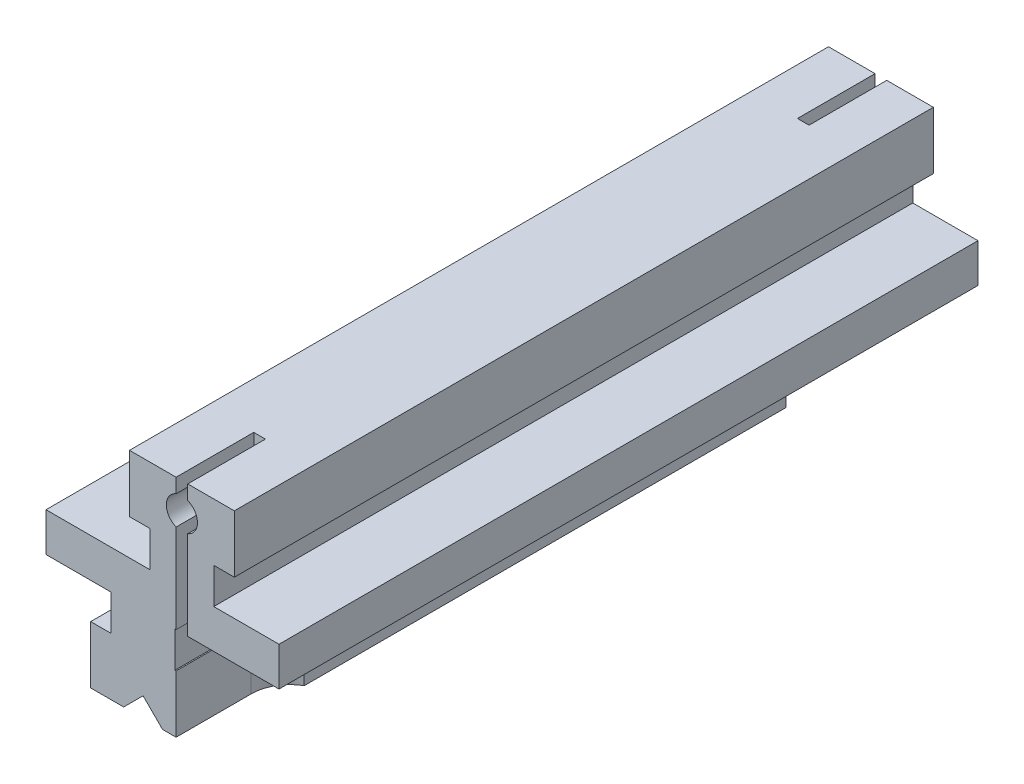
ISO-10303-21;
HEADER;
FILE_DESCRIPTION(('STEP AP214'),'2;1');
FILE_NAME('part.step','',(''),(''),'','','');
FILE_SCHEMA(('AUTOMOTIVE_DESIGN { 1 0 10303 214 1 1 1 1 }'));
ENDSEC;
DATA;
#1=APPLICATION_CONTEXT('core data for automotive mechanical design processes');
#2=APPLICATION_PROTOCOL_DEFINITION('international standard','automotive_design',2000,#1);
#3=PRODUCT_CONTEXT('',#1,'mechanical');
#4=PRODUCT('Part','Part','',(#3));
#5=PRODUCT_RELATED_PRODUCT_CATEGORY('part','',(#4));
#6=PRODUCT_DEFINITION_FORMATION('','',#4);
#7=PRODUCT_DEFINITION_CONTEXT('part definition',#1,'design');
#8=PRODUCT_DEFINITION('design','',#6,#7);
#9=PRODUCT_DEFINITION_SHAPE('','',#8);
#10=(LENGTH_UNIT() NAMED_UNIT(*) SI_UNIT(.MILLI.,.METRE.));
#11=(NAMED_UNIT(*) PLANE_ANGLE_UNIT() SI_UNIT($,.RADIAN.));
#12=(NAMED_UNIT(*) SI_UNIT($,.STERADIAN.) SOLID_ANGLE_UNIT());
#13=UNCERTAINTY_MEASURE_WITH_UNIT(LENGTH_MEASURE(1.E-05),#10,'distance_accuracy_value','');
#14=(GEOMETRIC_REPRESENTATION_CONTEXT(3) GLOBAL_UNCERTAINTY_ASSIGNED_CONTEXT((#13)) GLOBAL_UNIT_ASSIGNED_CONTEXT((#10,
#11,#12)) REPRESENTATION_CONTEXT('',''));
#15=CARTESIAN_POINT('',(0.,0.,0.));
#16=DIRECTION('',(0.,0.,1.));
#17=DIRECTION('',(1.,0.,0.));
#18=AXIS2_PLACEMENT_3D('',#15,#16,#17);
#19=CARTESIAN_POINT('',(5.,13.2999954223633,45.));
#20=DIRECTION('',(0.,0.,-1.));
#21=DIRECTION('',(-1.,0.,0.));
#22=AXIS2_PLACEMENT_3D('',#19,#20,#21);
#23=CYLINDRICAL_SURFACE('',#22,2.);
#24=DIRECTION('',(0.,0.,-1.));
#25=VECTOR('',#24,1.);
#26=CARTESIAN_POINT('',(5.75,11.4459458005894,45.));
#27=LINE('',#26,#25);
#28=CARTESIAN_POINT('',(5.75,11.4459458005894,35.));
#29=VERTEX_POINT('',#28);
#30=CARTESIAN_POINT('',(5.75,11.4459458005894,45.));
#31=VERTEX_POINT('',#30);
#32=EDGE_CURVE('E287',#29,#31,#27,.F.);
#33=ORIENTED_EDGE('',*,*,#32,.T.);
#34=CARTESIAN_POINT('',(5.,13.2999954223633,45.));
#35=DIRECTION('',(0.,0.,-1.));
#36=DIRECTION('',(-1.,0.,0.));
#37=AXIS2_PLACEMENT_3D('',#34,#35,#36);
#38=CIRCLE('',#37,2.);
#39=CARTESIAN_POINT('',(5.75,15.1540450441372,45.));
#40=VERTEX_POINT('',#39);
#41=EDGE_CURVE('E296',#40,#31,#38,.T.);
#42=ORIENTED_EDGE('',*,*,#41,.F.);
#43=DIRECTION('',(0.,0.,-1.));
#44=VECTOR('',#43,1.);
#45=CARTESIAN_POINT('',(5.75,15.1540450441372,45.));
#46=LINE('',#45,#44);
#47=CARTESIAN_POINT('',(5.75,15.1540450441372,35.));
#48=VERTEX_POINT('',#47);
#49=EDGE_CURVE('E292',#40,#48,#46,.T.);
#50=ORIENTED_EDGE('',*,*,#49,.T.);
#51=CARTESIAN_POINT('',(5.,13.2999954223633,35.));
#52=DIRECTION('',(0.,0.,-1.));
#53=DIRECTION('',(-1.,0.,0.));
#54=AXIS2_PLACEMENT_3D('',#51,#52,#53);
#55=CIRCLE('',#54,2.);
#56=EDGE_CURVE('E19',#29,#48,#55,.F.);
#57=ORIENTED_EDGE('',*,*,#56,.F.);
#58=EDGE_LOOP('',(#33,#42,#50,#57));
#59=FACE_BOUND('',#58,.T.);
#60=ADVANCED_FACE('F15',(#59),#23,.F.);
#61=CARTESIAN_POINT('',(9.10000610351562,5.,0.));
#62=DIRECTION('',(0.,1.,0.));
#63=DIRECTION('',(0.,0.,1.));
#64=AXIS2_PLACEMENT_3D('',#61,#62,#63);
#65=PLANE('',#64);
#66=DIRECTION('',(1.,0.,0.));
#67=VECTOR('',#66,1.);
#68=CARTESIAN_POINT('',(2.46334938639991,5.,-45.));
#69=LINE('',#68,#67);
#70=CARTESIAN_POINT('',(17.5,5.,-45.));
#71=VERTEX_POINT('',#70);
#72=CARTESIAN_POINT('',(9.10000610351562,5.,-45.));
#73=VERTEX_POINT('',#72);
#74=EDGE_CURVE('E449',#71,#73,#69,.F.);
#75=ORIENTED_EDGE('',*,*,#74,.T.);
#76=DIRECTION('',(0.,0.,-1.));
#77=VECTOR('',#76,1.);
#78=CARTESIAN_POINT('',(9.10000610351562,5.,0.));
#79=LINE('',#78,#77);
#80=CARTESIAN_POINT('',(9.10000610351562,5.,45.));
#81=VERTEX_POINT('',#80);
#82=EDGE_CURVE('E459',#81,#73,#79,.T.);
#83=ORIENTED_EDGE('',*,*,#82,.F.);
#84=DIRECTION('',(1.,0.,0.));
#85=VECTOR('',#84,1.);
#86=CARTESIAN_POINT('',(2.46334938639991,5.,45.));
#87=LINE('',#86,#85);
#88=CARTESIAN_POINT('',(17.5,5.,45.));
#89=VERTEX_POINT('',#88);
#90=EDGE_CURVE('E377',#89,#81,#87,.F.);
#91=ORIENTED_EDGE('',*,*,#90,.F.);
#92=DIRECTION('',(0.,0.,-1.));
#93=VECTOR('',#92,1.);
#94=CARTESIAN_POINT('',(17.5,5.,0.));
#95=LINE('',#94,#93);
#96=EDGE_CURVE('E458',#71,#89,#95,.F.);
#97=ORIENTED_EDGE('',*,*,#96,.F.);
#98=EDGE_LOOP('',(#75,#83,#91,#97));
#99=FACE_BOUND('',#98,.T.);
#100=ADVANCED_FACE('F475',(#99),#65,.T.);
#101=CARTESIAN_POINT('',(9.10000610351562,9.59999084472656,0.));
#102=DIRECTION('',(1.,0.,0.));
#103=DIRECTION('',(0.,0.,-1.));
#104=AXIS2_PLACEMENT_3D('',#101,#102,#103);
#105=PLANE('',#104);
#106=DIRECTION('',(0.,1.,0.));
#107=VECTOR('',#106,1.);
#108=CARTESIAN_POINT('',(9.10000610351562,2.34999266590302,-45.));
#109=LINE('',#108,#107);
#110=CARTESIAN_POINT('',(9.10000610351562,9.59999084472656,-45.));
#111=VERTEX_POINT('',#110);
#112=EDGE_CURVE('E463',#73,#111,#109,.T.);
#113=ORIENTED_EDGE('',*,*,#112,.T.);
#114=DIRECTION('',(0.,0.,-1.));
#115=VECTOR('',#114,1.);
#116=CARTESIAN_POINT('',(9.10000610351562,9.59999084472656,0.));
#117=LINE('',#116,#115);
#118=CARTESIAN_POINT('',(9.10000610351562,9.59999084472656,45.));
#119=VERTEX_POINT('',#118);
#120=EDGE_CURVE('E455',#119,#111,#117,.T.);
#121=ORIENTED_EDGE('',*,*,#120,.F.);
#122=DIRECTION('',(0.,1.,0.));
#123=VECTOR('',#122,1.);
#124=CARTESIAN_POINT('',(9.10000610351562,2.34999266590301,45.));
#125=LINE('',#124,#123);
#126=EDGE_CURVE('E372',#81,#119,#125,.T.);
#127=ORIENTED_EDGE('',*,*,#126,.F.);
#128=ORIENTED_EDGE('',*,*,#82,.T.);
#129=EDGE_LOOP('',(#113,#121,#127,#128));
#130=FACE_BOUND('',#129,.T.);
#131=ADVANCED_FACE('F479',(#130),#105,.T.);
#132=CARTESIAN_POINT('',(11.75,9.59999084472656,0.));
#133=DIRECTION('',(0.,-1.,0.));
#134=DIRECTION('',(0.,0.,-1.));
#135=AXIS2_PLACEMENT_3D('',#132,#133,#134);
#136=PLANE('',#135);
#137=DIRECTION('',(1.,0.,0.));
#138=VECTOR('',#137,1.);
#139=CARTESIAN_POINT('',(2.46334938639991,9.59999084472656,-45.));
#140=LINE('',#139,#138);
#141=CARTESIAN_POINT('',(11.75,9.59999084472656,-45.));
#142=VERTEX_POINT('',#141);
#143=EDGE_CURVE('E558',#111,#142,#140,.T.);
#144=ORIENTED_EDGE('',*,*,#143,.T.);
#145=DIRECTION('',(0.,0.,-1.));
#146=VECTOR('',#145,1.);
#147=CARTESIAN_POINT('',(11.75,9.59999084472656,0.));
#148=LINE('',#147,#146);
#149=CARTESIAN_POINT('',(11.75,9.59999084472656,45.));
#150=VERTEX_POINT('',#149);
#151=EDGE_CURVE('E367',#150,#142,#148,.T.);
#152=ORIENTED_EDGE('',*,*,#151,.F.);
#153=DIRECTION('',(1.,0.,0.));
#154=VECTOR('',#153,1.);
#155=CARTESIAN_POINT('',(2.46334938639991,9.59999084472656,45.));
#156=LINE('',#155,#154);
#157=EDGE_CURVE('E369',#119,#150,#156,.T.);
#158=ORIENTED_EDGE('',*,*,#157,.F.);
#159=ORIENTED_EDGE('',*,*,#120,.T.);
#160=EDGE_LOOP('',(#144,#152,#158,#159));
#161=FACE_BOUND('',#160,.T.);
#162=ADVANCED_FACE('F484',(#161),#136,.T.);
#163=CARTESIAN_POINT('',(5.,13.2999954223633,-45.));
#164=DIRECTION('',(0.,0.,1.));
#165=DIRECTION('',(0.,-1.,0.));
#166=AXIS2_PLACEMENT_3D('',#163,#164,#165);
#167=CYLINDRICAL_SURFACE('',#166,2.);
#168=DIRECTION('',(0.,0.,-1.));
#169=VECTOR('',#168,1.);
#170=CARTESIAN_POINT('',(5.75,15.1540450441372,-40.));
#171=LINE('',#170,#169);
#172=CARTESIAN_POINT('',(5.75,15.1540450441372,-35.));
#173=VERTEX_POINT('',#172);
#174=CARTESIAN_POINT('',(5.75,15.1540450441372,-45.));
#175=VERTEX_POINT('',#174);
#176=EDGE_CURVE('E301',#173,#175,#171,.T.);
#177=ORIENTED_EDGE('',*,*,#176,.T.);
#178=CARTESIAN_POINT('',(5.,13.2999954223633,-45.));
#179=DIRECTION('',(0.,0.,1.));
#180=DIRECTION('',(0.,-1.,0.));
#181=AXIS2_PLACEMENT_3D('',#178,#179,#180);
#182=CIRCLE('',#181,2.);
#183=CARTESIAN_POINT('',(5.75,11.4459458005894,-45.));
#184=VERTEX_POINT('',#183);
#185=EDGE_CURVE('E360',#175,#184,#182,.F.);
#186=ORIENTED_EDGE('',*,*,#185,.T.);
#187=DIRECTION('',(0.,0.,1.));
#188=VECTOR('',#187,1.);
#189=CARTESIAN_POINT('',(5.75,11.4459458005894,-40.));
#190=LINE('',#189,#188);
#191=CARTESIAN_POINT('',(5.75,11.4459458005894,-35.));
#192=VERTEX_POINT('',#191);
#193=EDGE_CURVE('E402',#184,#192,#190,.T.);
#194=ORIENTED_EDGE('',*,*,#193,.T.);
#195=CARTESIAN_POINT('',(5.00000000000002,13.2999954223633,-35.));
#196=DIRECTION('',(0.,0.,1.));
#197=DIRECTION('',(0.,-1.,0.));
#198=AXIS2_PLACEMENT_3D('',#195,#196,#197);
#199=CIRCLE('',#198,2.);
#200=EDGE_CURVE('E347',#173,#192,#199,.F.);
#201=ORIENTED_EDGE('',*,*,#200,.F.);
#202=EDGE_LOOP('',(#177,#186,#194,#201));
#203=FACE_BOUND('',#202,.T.);
#204=ADVANCED_FACE('F720',(#203),#167,.F.);
#205=CARTESIAN_POINT('',(17.5,5.,0.));
#206=DIRECTION('',(1.,0.,0.));
#207=DIRECTION('',(0.,0.,-1.));
#208=AXIS2_PLACEMENT_3D('',#205,#206,#207);
#209=PLANE('',#208);
#210=DIRECTION('',(0.,1.,0.));
#211=VECTOR('',#210,1.);
#212=CARTESIAN_POINT('',(17.5,2.34999266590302,-45.));
#213=LINE('',#212,#211);
#214=CARTESIAN_POINT('',(17.5,0.,-45.));
#215=VERTEX_POINT('',#214);
#216=EDGE_CURVE('E446',#215,#71,#213,.T.);
#217=ORIENTED_EDGE('',*,*,#216,.T.);
#218=ORIENTED_EDGE('',*,*,#96,.T.);
#219=DIRECTION('',(0.,1.,0.));
#220=VECTOR('',#219,1.);
#221=CARTESIAN_POINT('',(17.5,2.34999266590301,45.));
#222=LINE('',#221,#220);
#223=CARTESIAN_POINT('',(17.5,0.,45.));
#224=VERTEX_POINT('',#223);
#225=EDGE_CURVE('E316',#224,#89,#222,.T.);
#226=ORIENTED_EDGE('',*,*,#225,.F.);
#227=DIRECTION('',(0.,0.,-1.));
#228=VECTOR('',#227,1.);
#229=CARTESIAN_POINT('',(17.5,0.,0.));
#230=LINE('',#229,#228);
#231=EDGE_CURVE('E438',#215,#224,#230,.F.);
#232=ORIENTED_EDGE('',*,*,#231,.F.);
#233=EDGE_LOOP('',(#217,#218,#226,#232));
#234=FACE_BOUND('',#233,.T.);
#235=ADVANCED_FACE('F712',(#234),#209,.T.);
#236=CARTESIAN_POINT('',(5.75,-3.15674724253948,45.));
#237=DIRECTION('',(1.,0.,0.));
#238=DIRECTION('',(0.,0.,-1.));
#239=AXIS2_PLACEMENT_3D('',#236,#237,#238);
#240=PLANE('',#239);
#241=DIRECTION('',(0.,1.,0.));
#242=VECTOR('',#241,1.);
#243=CARTESIAN_POINT('',(5.75,2.34999266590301,45.));
#244=LINE('',#243,#242);
#245=CARTESIAN_POINT('',(5.75,0.,45.));
#246=VERTEX_POINT('',#245);
#247=EDGE_CURVE('E314',#31,#246,#244,.F.);
#248=ORIENTED_EDGE('',*,*,#247,.F.);
#249=ORIENTED_EDGE('',*,*,#32,.F.);
#250=DIRECTION('',(0.,1.,0.));
#251=VECTOR('',#250,1.);
#252=CARTESIAN_POINT('',(5.75,7.21322237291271,35.));
#253=LINE('',#252,#251);
#254=CARTESIAN_POINT('',(5.75,0.,35.));
#255=VERTEX_POINT('',#254);
#256=EDGE_CURVE('E309',#255,#29,#253,.T.);
#257=ORIENTED_EDGE('',*,*,#256,.F.);
#258=DIRECTION('',(0.,0.,-1.));
#259=VECTOR('',#258,1.);
#260=CARTESIAN_POINT('',(5.75,0.,0.));
#261=LINE('',#260,#259);
#262=EDGE_CURVE('E414',#246,#255,#261,.T.);
#263=ORIENTED_EDGE('',*,*,#262,.F.);
#264=EDGE_LOOP('',(#248,#249,#257,#263));
#265=FACE_BOUND('',#264,.T.);
#266=ADVANCED_FACE('F708',(#265),#240,.F.);
#267=CARTESIAN_POINT('',(5.75,11.4459458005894,-45.));
#268=DIRECTION('',(1.,0.,0.));
#269=DIRECTION('',(0.,0.,1.));
#270=AXIS2_PLACEMENT_3D('',#267,#268,#269);
#271=PLANE('',#270);
#272=DIRECTION('',(0.,-1.,0.));
#273=VECTOR('',#272,1.);
#274=CARTESIAN_POINT('',(5.75,8.5,-35.));
#275=LINE('',#274,#273);
#276=CARTESIAN_POINT('',(5.75,0.,-35.));
#277=VERTEX_POINT('',#276);
#278=EDGE_CURVE('E350',#192,#277,#275,.T.);
#279=ORIENTED_EDGE('',*,*,#278,.F.);
#280=ORIENTED_EDGE('',*,*,#193,.F.);
#281=DIRECTION('',(0.,1.,0.));
#282=VECTOR('',#281,1.);
#283=CARTESIAN_POINT('',(5.75,2.34999266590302,-45.));
#284=LINE('',#283,#282);
#285=CARTESIAN_POINT('',(5.75,0.,-45.));
#286=VERTEX_POINT('',#285);
#287=EDGE_CURVE('E361',#184,#286,#284,.F.);
#288=ORIENTED_EDGE('',*,*,#287,.T.);
#289=DIRECTION('',(0.,0.,-1.));
#290=VECTOR('',#289,1.);
#291=CARTESIAN_POINT('',(5.75,0.,0.));
#292=LINE('',#291,#290);
#293=EDGE_CURVE('E407',#277,#286,#292,.T.);
#294=ORIENTED_EDGE('',*,*,#293,.F.);
#295=EDGE_LOOP('',(#279,#280,#288,#294));
#296=FACE_BOUND('',#295,.T.);
#297=ADVANCED_FACE('F717',(#296),#271,.F.);
#298=CARTESIAN_POINT('',(5.,7.21322237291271,35.));
#299=DIRECTION('',(0.,0.,1.));
#300=DIRECTION('',(1.,0.,0.));
#301=AXIS2_PLACEMENT_3D('',#298,#299,#300);
#302=PLANE('',#301);
#303=CARTESIAN_POINT('',(5.,13.2999954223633,35.));
#304=DIRECTION('',(0.,0.,-1.));
#305=DIRECTION('',(-1.,0.,0.));
#306=AXIS2_PLACEMENT_3D('',#303,#304,#305);
#307=CIRCLE('',#306,2.);
#308=CARTESIAN_POINT('',(4.24999999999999,15.1540450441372,35.));
#309=VERTEX_POINT('',#308);
#310=CARTESIAN_POINT('',(4.24999999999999,11.4459458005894,35.));
#311=VERTEX_POINT('',#310);
#312=EDGE_CURVE('E343',#309,#311,#307,.F.);
#313=ORIENTED_EDGE('',*,*,#312,.T.);
#314=DIRECTION('',(0.,1.,0.));
#315=VECTOR('',#314,1.);
#316=CARTESIAN_POINT('',(4.24999999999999,11.4459458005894,35.));
#317=LINE('',#316,#315);
#318=CARTESIAN_POINT('',(4.24999999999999,0.,35.));
#319=VERTEX_POINT('',#318);
#320=EDGE_CURVE('E404',#311,#319,#317,.F.);
#321=ORIENTED_EDGE('',*,*,#320,.T.);
#322=DIRECTION('',(1.,0.,0.));
#323=VECTOR('',#322,1.);
#324=CARTESIAN_POINT('',(17.5,0.,35.));
#325=LINE('',#324,#323);
#326=EDGE_CURVE('E411',#255,#319,#325,.F.);
#327=ORIENTED_EDGE('',*,*,#326,.F.);
#328=ORIENTED_EDGE('',*,*,#256,.T.);
#329=ORIENTED_EDGE('',*,*,#56,.T.);
#330=DIRECTION('',(0.,1.,0.));
#331=VECTOR('',#330,1.);
#332=CARTESIAN_POINT('',(5.75,15.1540450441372,35.));
#333=LINE('',#332,#331);
#334=CARTESIAN_POINT('',(5.75,17.,35.));
#335=VERTEX_POINT('',#334);
#336=EDGE_CURVE('E300',#48,#335,#333,.T.);
#337=ORIENTED_EDGE('',*,*,#336,.T.);
#338=DIRECTION('',(1.,0.,0.));
#339=VECTOR('',#338,1.);
#340=CARTESIAN_POINT('',(5.,17.,35.));
#341=LINE('',#340,#339);
#342=CARTESIAN_POINT('',(4.24999999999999,17.,35.));
#343=VERTEX_POINT('',#342);
#344=EDGE_CURVE('E310',#335,#343,#341,.F.);
#345=ORIENTED_EDGE('',*,*,#344,.T.);
#346=DIRECTION('',(0.,1.,0.));
#347=VECTOR('',#346,1.);
#348=CARTESIAN_POINT('',(4.24999999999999,17.,35.));
#349=LINE('',#348,#347);
#350=EDGE_CURVE('E379',#343,#309,#349,.F.);
#351=ORIENTED_EDGE('',*,*,#350,.T.);
#352=EDGE_LOOP('',(#313,#321,#327,#328,#329,#337,#345,#351));
#353=FACE_BOUND('',#352,.T.);
#354=ADVANCED_FACE('F306',(#353),#302,.T.);
#355=CARTESIAN_POINT('',(5.75,17.,-45.));
#356=DIRECTION('',(1.,0.,0.));
#357=DIRECTION('',(0.,0.,1.));
#358=AXIS2_PLACEMENT_3D('',#355,#356,#357);
#359=PLANE('',#358);
#360=DIRECTION('',(0.,0.,1.));
#361=VECTOR('',#360,1.);
#362=CARTESIAN_POINT('',(5.75,17.,0.));
#363=LINE('',#362,#361);
#364=CARTESIAN_POINT('',(5.75,17.,-45.));
#365=VERTEX_POINT('',#364);
#366=CARTESIAN_POINT('',(5.75,17.,-35.));
#367=VERTEX_POINT('',#366);
#368=EDGE_CURVE('E385',#365,#367,#363,.T.);
#369=ORIENTED_EDGE('',*,*,#368,.F.);
#370=DIRECTION('',(0.,1.,0.));
#371=VECTOR('',#370,1.);
#372=CARTESIAN_POINT('',(5.75,2.34999266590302,-45.));
#373=LINE('',#372,#371);
#374=EDGE_CURVE('E362',#365,#175,#373,.F.);
#375=ORIENTED_EDGE('',*,*,#374,.T.);
#376=ORIENTED_EDGE('',*,*,#176,.F.);
#377=DIRECTION('',(0.,-1.,0.));
#378=VECTOR('',#377,1.);
#379=CARTESIAN_POINT('',(5.75,8.5,-35.));
#380=LINE('',#379,#378);
#381=EDGE_CURVE('E351',#367,#173,#380,.T.);
#382=ORIENTED_EDGE('',*,*,#381,.F.);
#383=EDGE_LOOP('',(#369,#375,#376,#382));
#384=FACE_BOUND('',#383,.T.);
#385=ADVANCED_FACE('F567',(#384),#359,.F.);
#386=CARTESIAN_POINT('',(5.75,15.1540450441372,45.));
#387=DIRECTION('',(1.,0.,0.));
#388=DIRECTION('',(0.,0.,-1.));
#389=AXIS2_PLACEMENT_3D('',#386,#387,#388);
#390=PLANE('',#389);
#391=ORIENTED_EDGE('',*,*,#49,.F.);
#392=DIRECTION('',(0.,1.,0.));
#393=VECTOR('',#392,1.);
#394=CARTESIAN_POINT('',(5.75,2.34999266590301,45.));
#395=LINE('',#394,#393);
#396=CARTESIAN_POINT('',(5.75,17.,45.));
#397=VERTEX_POINT('',#396);
#398=EDGE_CURVE('E364',#397,#40,#395,.F.);
#399=ORIENTED_EDGE('',*,*,#398,.F.);
#400=DIRECTION('',(0.,0.,1.));
#401=VECTOR('',#400,1.);
#402=CARTESIAN_POINT('',(5.75,17.,0.));
#403=LINE('',#402,#401);
#404=EDGE_CURVE('E313',#335,#397,#403,.T.);
#405=ORIENTED_EDGE('',*,*,#404,.F.);
#406=ORIENTED_EDGE('',*,*,#336,.F.);
#407=EDGE_LOOP('',(#391,#399,#405,#406));
#408=FACE_BOUND('',#407,.T.);
#409=ADVANCED_FACE('F311',(#408),#390,.F.);
#410=CARTESIAN_POINT('',(2.46334938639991,2.34999266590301,45.));
#411=DIRECTION('',(0.,0.,1.));
#412=DIRECTION('',(1.,0.,0.));
#413=AXIS2_PLACEMENT_3D('',#410,#411,#412);
#414=PLANE('',#413);
#415=ORIENTED_EDGE('',*,*,#398,.T.);
#416=ORIENTED_EDGE('',*,*,#41,.T.);
#417=ORIENTED_EDGE('',*,*,#247,.T.);
#418=DIRECTION('',(1.,0.,0.));
#419=VECTOR('',#418,1.);
#420=CARTESIAN_POINT('',(17.5,0.,45.));
#421=LINE('',#420,#419);
#422=EDGE_CURVE('E435',#224,#246,#421,.F.);
#423=ORIENTED_EDGE('',*,*,#422,.F.);
#424=ORIENTED_EDGE('',*,*,#225,.T.);
#425=ORIENTED_EDGE('',*,*,#90,.T.);
#426=ORIENTED_EDGE('',*,*,#126,.T.);
#427=ORIENTED_EDGE('',*,*,#157,.T.);
#428=DIRECTION('',(0.,1.,0.));
#429=VECTOR('',#428,1.);
#430=CARTESIAN_POINT('',(11.75,17.,45.));
#431=LINE('',#430,#429);
#432=CARTESIAN_POINT('',(11.75,17.,45.));
#433=VERTEX_POINT('',#432);
#434=EDGE_CURVE('E363',#433,#150,#431,.F.);
#435=ORIENTED_EDGE('',*,*,#434,.F.);
#436=DIRECTION('',(1.,0.,0.));
#437=VECTOR('',#436,1.);
#438=CARTESIAN_POINT('',(-1.75000000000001,17.,45.));
#439=LINE('',#438,#437);
#440=EDGE_CURVE('E465',#397,#433,#439,.T.);
#441=ORIENTED_EDGE('',*,*,#440,.F.);
#442=EDGE_LOOP('',(#415,#416,#417,#423,#424,#425,#426,#427,#435,#441));
#443=FACE_BOUND('',#442,.T.);
#444=ADVANCED_FACE('F471',(#443),#414,.T.);
#445=CARTESIAN_POINT('',(11.75,17.,0.));
#446=DIRECTION('',(1.,0.,0.));
#447=DIRECTION('',(0.,0.,-1.));
#448=AXIS2_PLACEMENT_3D('',#445,#446,#447);
#449=PLANE('',#448);
#450=DIRECTION('',(0.,1.,0.));
#451=VECTOR('',#450,1.);
#452=CARTESIAN_POINT('',(11.75,2.34999266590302,-45.));
#453=LINE('',#452,#451);
#454=CARTESIAN_POINT('',(11.75,17.,-45.));
#455=VERTEX_POINT('',#454);
#456=EDGE_CURVE('E491',#142,#455,#453,.T.);
#457=ORIENTED_EDGE('',*,*,#456,.T.);
#458=DIRECTION('',(0.,0.,1.));
#459=VECTOR('',#458,1.);
#460=CARTESIAN_POINT('',(11.75,17.,0.));
#461=LINE('',#460,#459);
#462=EDGE_CURVE('E396',#433,#455,#461,.F.);
#463=ORIENTED_EDGE('',*,*,#462,.F.);
#464=ORIENTED_EDGE('',*,*,#434,.T.);
#465=ORIENTED_EDGE('',*,*,#151,.T.);
#466=EDGE_LOOP('',(#457,#463,#464,#465));
#467=FACE_BOUND('',#466,.T.);
#468=ADVANCED_FACE('F489',(#467),#449,.T.);
#469=CARTESIAN_POINT('',(2.46334938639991,2.34999266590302,-45.));
#470=DIRECTION('',(0.,0.,1.));
#471=DIRECTION('',(1.,0.,0.));
#472=AXIS2_PLACEMENT_3D('',#469,#470,#471);
#473=PLANE('',#472);
#474=ORIENTED_EDGE('',*,*,#185,.F.);
#475=ORIENTED_EDGE('',*,*,#374,.F.);
#476=DIRECTION('',(1.,0.,0.));
#477=VECTOR('',#476,1.);
#478=CARTESIAN_POINT('',(-1.75000000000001,17.,-45.));
#479=LINE('',#478,#477);
#480=EDGE_CURVE('E392',#455,#365,#479,.F.);
#481=ORIENTED_EDGE('',*,*,#480,.F.);
#482=ORIENTED_EDGE('',*,*,#456,.F.);
#483=ORIENTED_EDGE('',*,*,#143,.F.);
#484=ORIENTED_EDGE('',*,*,#112,.F.);
#485=ORIENTED_EDGE('',*,*,#74,.F.);
#486=ORIENTED_EDGE('',*,*,#216,.F.);
#487=DIRECTION('',(1.,0.,0.));
#488=VECTOR('',#487,1.);
#489=CARTESIAN_POINT('',(17.5,0.,-45.));
#490=LINE('',#489,#488);
#491=EDGE_CURVE('E443',#286,#215,#490,.T.);
#492=ORIENTED_EDGE('',*,*,#491,.F.);
#493=ORIENTED_EDGE('',*,*,#287,.F.);
#494=EDGE_LOOP('',(#474,#475,#481,#482,#483,#484,#485,#486,#492,#493));
#495=FACE_BOUND('',#494,.T.);
#496=ADVANCED_FACE('F562',(#495),#473,.F.);
#497=CARTESIAN_POINT('',(6.75,-4.59999847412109,0.));
#498=DIRECTION('',(1.,0.,0.));
#499=DIRECTION('',(0.,0.,-1.));
#500=AXIS2_PLACEMENT_3D('',#497,#498,#499);
#501=PLANE('',#500);
#502=DIRECTION('',(0.,1.,0.));
#503=VECTOR('',#502,1.);
#504=CARTESIAN_POINT('',(6.75,-12.,31.));
#505=LINE('',#504,#503);
#506=CARTESIAN_POINT('',(6.75,-4.59999847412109,31.));
#507=VERTEX_POINT('',#506);
#508=CARTESIAN_POINT('',(6.75,-12.,31.));
#509=VERTEX_POINT('',#508);
#510=EDGE_CURVE('E551',#507,#509,#505,.F.);
#511=ORIENTED_EDGE('',*,*,#510,.T.);
#512=DIRECTION('',(0.,0.,-1.));
#513=VECTOR('',#512,1.);
#514=CARTESIAN_POINT('',(6.75,-12.,0.));
#515=LINE('',#514,#513);
#516=CARTESIAN_POINT('',(6.75,-12.,-31.));
#517=VERTEX_POINT('',#516);
#518=EDGE_CURVE('E334',#517,#509,#515,.F.);
#519=ORIENTED_EDGE('',*,*,#518,.F.);
#520=DIRECTION('',(0.,1.,0.));
#521=VECTOR('',#520,1.);
#522=CARTESIAN_POINT('',(6.75,-8.29999923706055,-31.));
#523=LINE('',#522,#521);
#524=CARTESIAN_POINT('',(6.75,-4.59999847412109,-31.));
#525=VERTEX_POINT('',#524);
#526=EDGE_CURVE('E535',#517,#525,#523,.T.);
#527=ORIENTED_EDGE('',*,*,#526,.T.);
#528=DIRECTION('',(0.,0.,1.));
#529=VECTOR('',#528,1.);
#530=CARTESIAN_POINT('',(6.75,-4.59999847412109,0.));
#531=LINE('',#530,#529);
#532=EDGE_CURVE('E355',#507,#525,#531,.F.);
#533=ORIENTED_EDGE('',*,*,#532,.F.);
#534=EDGE_LOOP('',(#511,#519,#527,#533));
#535=FACE_BOUND('',#534,.T.);
#536=ADVANCED_FACE('F788',(#535),#501,.T.);
#537=CARTESIAN_POINT('',(9.25,-12.,35.3301270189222));
#538=DIRECTION('',(0.,1.,0.));
#539=DIRECTION('',(0.,0.,1.));
#540=AXIS2_PLACEMENT_3D('',#537,#538,#539);
#541=CYLINDRICAL_SURFACE('',#540,5.);
#542=DIRECTION('',(0.,1.,0.));
#543=VECTOR('',#542,1.);
#544=CARTESIAN_POINT('',(4.25,-12.,35.3301270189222));
#545=LINE('',#544,#543);
#546=CARTESIAN_POINT('',(4.25,-4.59999847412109,35.3301270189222));
#547=VERTEX_POINT('',#546);
#548=CARTESIAN_POINT('',(4.25,-12.,35.3301270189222));
#549=VERTEX_POINT('',#548);
#550=EDGE_CURVE('E382',#547,#549,#545,.F.);
#551=ORIENTED_EDGE('',*,*,#550,.T.);
#552=CARTESIAN_POINT('',(9.25,-12.,35.3301270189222));
#553=DIRECTION('',(0.,1.,0.));
#554=DIRECTION('',(0.,0.,1.));
#555=AXIS2_PLACEMENT_3D('',#552,#553,#554);
#556=CIRCLE('',#555,5.);
#557=EDGE_CURVE('E330',#509,#549,#556,.T.);
#558=ORIENTED_EDGE('',*,*,#557,.F.);
#559=ORIENTED_EDGE('',*,*,#510,.F.);
#560=CARTESIAN_POINT('',(9.25,-4.59999847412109,35.3301270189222));
#561=DIRECTION('',(0.,1.,0.));
#562=DIRECTION('',(0.,0.,1.));
#563=AXIS2_PLACEMENT_3D('',#560,#561,#562);
#564=CIRCLE('',#563,5.);
#565=EDGE_CURVE('E356',#547,#507,#564,.F.);
#566=ORIENTED_EDGE('',*,*,#565,.F.);
#567=EDGE_LOOP('',(#551,#558,#559,#566));
#568=FACE_BOUND('',#567,.T.);
#569=ADVANCED_FACE('F784',(#568),#541,.F.);
#570=CARTESIAN_POINT('',(9.25,-12.,-35.3301270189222));
#571=DIRECTION('',(0.,1.,0.));
#572=DIRECTION('',(0.,0.,1.));
#573=AXIS2_PLACEMENT_3D('',#570,#571,#572);
#574=CYLINDRICAL_SURFACE('',#573,5.);
#575=ORIENTED_EDGE('',*,*,#526,.F.);
#576=CARTESIAN_POINT('',(9.25,-12.,-35.3301270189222));
#577=DIRECTION('',(0.,1.,0.));
#578=DIRECTION('',(0.,0.,1.));
#579=AXIS2_PLACEMENT_3D('',#576,#577,#578);
#580=CIRCLE('',#579,5.);
#581=CARTESIAN_POINT('',(4.25,-12.,-35.3301270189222));
#582=VERTEX_POINT('',#581);
#583=EDGE_CURVE('E335',#582,#517,#580,.T.);
#584=ORIENTED_EDGE('',*,*,#583,.F.);
#585=DIRECTION('',(0.,1.,0.));
#586=VECTOR('',#585,1.);
#587=CARTESIAN_POINT('',(4.25,-8.29999923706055,-35.3301270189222));
#588=LINE('',#587,#586);
#589=CARTESIAN_POINT('',(4.25,-4.59999847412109,-35.3301270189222));
#590=VERTEX_POINT('',#589);
#591=EDGE_CURVE('E529',#582,#590,#588,.T.);
#592=ORIENTED_EDGE('',*,*,#591,.T.);
#593=CARTESIAN_POINT('',(9.25,-4.59999847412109,-35.3301270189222));
#594=DIRECTION('',(0.,1.,0.));
#595=DIRECTION('',(0.,0.,1.));
#596=AXIS2_PLACEMENT_3D('',#593,#594,#595);
#597=CIRCLE('',#596,5.);
#598=EDGE_CURVE('E352',#525,#590,#597,.F.);
#599=ORIENTED_EDGE('',*,*,#598,.F.);
#600=EDGE_LOOP('',(#575,#584,#592,#599));
#601=FACE_BOUND('',#600,.T.);
#602=ADVANCED_FACE('F791',(#601),#574,.F.);
#603=CARTESIAN_POINT('',(4.10000610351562,-4.59999847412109,0.));
#604=DIRECTION('',(0.,1.,0.));
#605=DIRECTION('',(0.,0.,1.));
#606=AXIS2_PLACEMENT_3D('',#603,#604,#605);
#607=PLANE('',#606);
#608=ORIENTED_EDGE('',*,*,#532,.T.);
#609=ORIENTED_EDGE('',*,*,#598,.T.);
#610=DIRECTION('',(0.,0.,-1.));
#611=VECTOR('',#610,1.);
#612=CARTESIAN_POINT('',(4.25,-4.59999847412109,-40.1650635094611));
#613=LINE('',#612,#611);
#614=CARTESIAN_POINT('',(4.25,-4.59999847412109,-45.));
#615=VERTEX_POINT('',#614);
#616=EDGE_CURVE('E454',#590,#615,#613,.T.);
#617=ORIENTED_EDGE('',*,*,#616,.T.);
#618=DIRECTION('',(1.,0.,0.));
#619=VECTOR('',#618,1.);
#620=CARTESIAN_POINT('',(4.10000610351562,-4.59999847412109,-45.));
#621=LINE('',#620,#619);
#622=CARTESIAN_POINT('',(4.10000610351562,-4.59999847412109,-45.));
#623=VERTEX_POINT('',#622);
#624=EDGE_CURVE('E400',#615,#623,#621,.F.);
#625=ORIENTED_EDGE('',*,*,#624,.T.);
#626=DIRECTION('',(0.,0.,-1.));
#627=VECTOR('',#626,1.);
#628=CARTESIAN_POINT('',(4.10000610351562,-4.59999847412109,0.));
#629=LINE('',#628,#627);
#630=CARTESIAN_POINT('',(4.10000610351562,-4.59999847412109,45.));
#631=VERTEX_POINT('',#630);
#632=EDGE_CURVE('E422',#631,#623,#629,.T.);
#633=ORIENTED_EDGE('',*,*,#632,.F.);
#634=DIRECTION('',(1.,0.,0.));
#635=VECTOR('',#634,1.);
#636=CARTESIAN_POINT('',(4.10000610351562,-4.59999847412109,45.));
#637=LINE('',#636,#635);
#638=CARTESIAN_POINT('',(4.25,-4.59999847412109,45.));
#639=VERTEX_POINT('',#638);
#640=EDGE_CURVE('E359',#631,#639,#637,.T.);
#641=ORIENTED_EDGE('',*,*,#640,.T.);
#642=DIRECTION('',(0.,0.,1.));
#643=VECTOR('',#642,1.);
#644=CARTESIAN_POINT('',(4.25,-4.59999847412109,45.));
#645=LINE('',#644,#643);
#646=EDGE_CURVE('E342',#639,#547,#645,.F.);
#647=ORIENTED_EDGE('',*,*,#646,.T.);
#648=ORIENTED_EDGE('',*,*,#565,.T.);
#649=EDGE_LOOP('',(#608,#609,#617,#625,#633,#641,#647,#648));
#650=FACE_BOUND('',#649,.T.);
#651=ADVANCED_FACE('F735',(#650),#607,.T.);
#652=CARTESIAN_POINT('',(2.96,17.,-35.));
#653=DIRECTION('',(0.,0.,-1.));
#654=DIRECTION('',(1.,0.,0.));
#655=AXIS2_PLACEMENT_3D('',#652,#653,#654);
#656=PLANE('',#655);
#657=ORIENTED_EDGE('',*,*,#200,.T.);
#658=ORIENTED_EDGE('',*,*,#278,.T.);
#659=DIRECTION('',(1.,0.,0.));
#660=VECTOR('',#659,1.);
#661=CARTESIAN_POINT('',(17.5,0.,-35.));
#662=LINE('',#661,#660);
#663=CARTESIAN_POINT('',(4.25,0.,-35.));
#664=VERTEX_POINT('',#663);
#665=EDGE_CURVE('E417',#664,#277,#662,.T.);
#666=ORIENTED_EDGE('',*,*,#665,.F.);
#667=DIRECTION('',(0.,1.,0.));
#668=VECTOR('',#667,1.);
#669=CARTESIAN_POINT('',(4.25,5.72297290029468,-35.));
#670=LINE('',#669,#668);
#671=CARTESIAN_POINT('',(4.25,11.4459458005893,-35.));
#672=VERTEX_POINT('',#671);
#673=EDGE_CURVE('E421',#664,#672,#670,.T.);
#674=ORIENTED_EDGE('',*,*,#673,.T.);
#675=CARTESIAN_POINT('',(4.99999999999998,13.2999954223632,-35.));
#676=DIRECTION('',(0.,0.,1.));
#677=DIRECTION('',(0.,-1.,0.));
#678=AXIS2_PLACEMENT_3D('',#675,#676,#677);
#679=CIRCLE('',#678,2.);
#680=CARTESIAN_POINT('',(4.24999999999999,15.1540450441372,-35.));
#681=VERTEX_POINT('',#680);
#682=EDGE_CURVE('E339',#672,#681,#679,.F.);
#683=ORIENTED_EDGE('',*,*,#682,.T.);
#684=DIRECTION('',(0.,1.,0.));
#685=VECTOR('',#684,1.);
#686=CARTESIAN_POINT('',(4.24999999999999,16.0770225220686,-35.));
#687=LINE('',#686,#685);
#688=CARTESIAN_POINT('',(4.24999999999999,17.,-35.));
#689=VERTEX_POINT('',#688);
#690=EDGE_CURVE('E383',#681,#689,#687,.T.);
#691=ORIENTED_EDGE('',*,*,#690,.T.);
#692=DIRECTION('',(1.,0.,0.));
#693=VECTOR('',#692,1.);
#694=CARTESIAN_POINT('',(-1.75000000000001,17.,-35.));
#695=LINE('',#694,#693);
#696=EDGE_CURVE('E386',#367,#689,#695,.F.);
#697=ORIENTED_EDGE('',*,*,#696,.F.);
#698=ORIENTED_EDGE('',*,*,#381,.T.);
#699=EDGE_LOOP('',(#657,#658,#666,#674,#683,#691,#697,#698));
#700=FACE_BOUND('',#699,.T.);
#701=ADVANCED_FACE('F570',(#700),#656,.T.);
#702=CARTESIAN_POINT('',(17.5,0.,0.));
#703=DIRECTION('',(0.,-1.,0.));
#704=DIRECTION('',(0.,0.,-1.));
#705=AXIS2_PLACEMENT_3D('',#702,#703,#704);
#706=PLANE('',#705);
#707=ORIENTED_EDGE('',*,*,#665,.T.);
#708=ORIENTED_EDGE('',*,*,#293,.T.);
#709=ORIENTED_EDGE('',*,*,#491,.T.);
#710=ORIENTED_EDGE('',*,*,#231,.T.);
#711=ORIENTED_EDGE('',*,*,#422,.T.);
#712=ORIENTED_EDGE('',*,*,#262,.T.);
#713=ORIENTED_EDGE('',*,*,#326,.T.);
#714=DIRECTION('',(0.,0.,1.));
#715=VECTOR('',#714,1.);
#716=CARTESIAN_POINT('',(4.24999999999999,0.,45.));
#717=LINE('',#716,#715);
#718=CARTESIAN_POINT('',(4.25,0.,45.));
#719=VERTEX_POINT('',#718);
#720=EDGE_CURVE('E406',#319,#719,#717,.T.);
#721=ORIENTED_EDGE('',*,*,#720,.T.);
#722=DIRECTION('',(1.,0.,0.));
#723=VECTOR('',#722,1.);
#724=CARTESIAN_POINT('',(17.5,0.,45.));
#725=LINE('',#724,#723);
#726=CARTESIAN_POINT('',(4.10000610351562,0.,45.));
#727=VERTEX_POINT('',#726);
#728=EDGE_CURVE('E408',#719,#727,#725,.F.);
#729=ORIENTED_EDGE('',*,*,#728,.T.);
#730=DIRECTION('',(0.,0.,-1.));
#731=VECTOR('',#730,1.);
#732=CARTESIAN_POINT('',(4.10000610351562,0.,0.));
#733=LINE('',#732,#731);
#734=CARTESIAN_POINT('',(4.10000610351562,0.,-45.));
#735=VERTEX_POINT('',#734);
#736=EDGE_CURVE('E418',#735,#727,#733,.F.);
#737=ORIENTED_EDGE('',*,*,#736,.F.);
#738=DIRECTION('',(1.,0.,0.));
#739=VECTOR('',#738,1.);
#740=CARTESIAN_POINT('',(17.5,0.,-45.));
#741=LINE('',#740,#739);
#742=CARTESIAN_POINT('',(4.25,0.,-45.));
#743=VERTEX_POINT('',#742);
#744=EDGE_CURVE('E410',#735,#743,#741,.T.);
#745=ORIENTED_EDGE('',*,*,#744,.T.);
#746=DIRECTION('',(0.,0.,1.));
#747=VECTOR('',#746,1.);
#748=CARTESIAN_POINT('',(4.25,0.,-40.));
#749=LINE('',#748,#747);
#750=EDGE_CURVE('E606',#743,#664,#749,.T.);
#751=ORIENTED_EDGE('',*,*,#750,.T.);
#752=EDGE_LOOP('',(#707,#708,#709,#710,#711,#712,#713,#721,#729,#737,#745,#751));
#753=FACE_BOUND('',#752,.T.);
#754=ADVANCED_FACE('F706',(#753),#706,.T.);
#755=CARTESIAN_POINT('',(4.24999999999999,11.4459458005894,45.));
#756=DIRECTION('',(-1.,0.,0.));
#757=DIRECTION('',(0.,0.,1.));
#758=AXIS2_PLACEMENT_3D('',#755,#756,#757);
#759=PLANE('',#758);
#760=ORIENTED_EDGE('',*,*,#320,.F.);
#761=DIRECTION('',(0.,0.,-1.));
#762=VECTOR('',#761,1.);
#763=CARTESIAN_POINT('',(4.24999999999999,11.4459458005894,45.));
#764=LINE('',#763,#762);
#765=CARTESIAN_POINT('',(4.24999999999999,11.4459458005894,45.));
#766=VERTEX_POINT('',#765);
#767=EDGE_CURVE('E346',#311,#766,#764,.F.);
#768=ORIENTED_EDGE('',*,*,#767,.T.);
#769=DIRECTION('',(0.,1.,0.));
#770=VECTOR('',#769,1.);
#771=CARTESIAN_POINT('',(4.25,2.34999266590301,45.));
#772=LINE('',#771,#770);
#773=EDGE_CURVE('E329',#719,#766,#772,.T.);
#774=ORIENTED_EDGE('',*,*,#773,.F.);
#775=ORIENTED_EDGE('',*,*,#720,.F.);
#776=EDGE_LOOP('',(#760,#768,#774,#775));
#777=FACE_BOUND('',#776,.T.);
#778=ADVANCED_FACE('F703',(#777),#759,.F.);
#779=CARTESIAN_POINT('',(5.,13.2999954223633,45.));
#780=DIRECTION('',(0.,0.,-1.));
#781=DIRECTION('',(-1.,0.,0.));
#782=AXIS2_PLACEMENT_3D('',#779,#780,#781);
#783=CYLINDRICAL_SURFACE('',#782,2.);
#784=DIRECTION('',(0.,0.,1.));
#785=VECTOR('',#784,1.);
#786=CARTESIAN_POINT('',(4.24999999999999,15.1540450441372,45.));
#787=LINE('',#786,#785);
#788=CARTESIAN_POINT('',(4.24999999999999,15.1540450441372,45.));
#789=VERTEX_POINT('',#788);
#790=EDGE_CURVE('E345',#309,#789,#787,.T.);
#791=ORIENTED_EDGE('',*,*,#790,.T.);
#792=CARTESIAN_POINT('',(5.,13.2999954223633,45.));
#793=DIRECTION('',(0.,0.,-1.));
#794=DIRECTION('',(-1.,0.,0.));
#795=AXIS2_PLACEMENT_3D('',#792,#793,#794);
#796=CIRCLE('',#795,2.);
#797=EDGE_CURVE('E325',#766,#789,#796,.T.);
#798=ORIENTED_EDGE('',*,*,#797,.F.);
#799=ORIENTED_EDGE('',*,*,#767,.F.);
#800=ORIENTED_EDGE('',*,*,#312,.F.);
#801=EDGE_LOOP('',(#791,#798,#799,#800));
#802=FACE_BOUND('',#801,.T.);
#803=ADVANCED_FACE('F701',(#802),#783,.F.);
#804=CARTESIAN_POINT('',(4.24999999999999,17.,45.));
#805=DIRECTION('',(-1.,0.,0.));
#806=DIRECTION('',(0.,0.,1.));
#807=AXIS2_PLACEMENT_3D('',#804,#805,#806);
#808=PLANE('',#807);
#809=DIRECTION('',(0.,0.,1.));
#810=VECTOR('',#809,1.);
#811=CARTESIAN_POINT('',(4.24999999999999,17.,0.));
#812=LINE('',#811,#810);
#813=CARTESIAN_POINT('',(4.24999999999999,17.,45.));
#814=VERTEX_POINT('',#813);
#815=EDGE_CURVE('E468',#814,#343,#812,.F.);
#816=ORIENTED_EDGE('',*,*,#815,.F.);
#817=DIRECTION('',(0.,1.,0.));
#818=VECTOR('',#817,1.);
#819=CARTESIAN_POINT('',(4.24999999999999,2.34999266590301,45.));
#820=LINE('',#819,#818);
#821=EDGE_CURVE('E328',#789,#814,#820,.T.);
#822=ORIENTED_EDGE('',*,*,#821,.F.);
#823=ORIENTED_EDGE('',*,*,#790,.F.);
#824=ORIENTED_EDGE('',*,*,#350,.F.);
#825=EDGE_LOOP('',(#816,#822,#823,#824));
#826=FACE_BOUND('',#825,.T.);
#827=ADVANCED_FACE('F501',(#826),#808,.F.);
#828=CARTESIAN_POINT('',(4.25,-12.,45.));
#829=DIRECTION('',(-1.,0.,0.));
#830=DIRECTION('',(0.,0.,1.));
#831=AXIS2_PLACEMENT_3D('',#828,#829,#830);
#832=PLANE('',#831);
#833=DIRECTION('',(0.,1.,0.));
#834=VECTOR('',#833,1.);
#835=CARTESIAN_POINT('',(4.25,2.34999266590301,45.));
#836=LINE('',#835,#834);
#837=CARTESIAN_POINT('',(4.25,-12.,45.));
#838=VERTEX_POINT('',#837);
#839=EDGE_CURVE('E432',#838,#639,#836,.T.);
#840=ORIENTED_EDGE('',*,*,#839,.F.);
#841=DIRECTION('',(0.,0.,-1.));
#842=VECTOR('',#841,1.);
#843=CARTESIAN_POINT('',(4.25,-12.,0.));
#844=LINE('',#843,#842);
#845=EDGE_CURVE('E333',#549,#838,#844,.F.);
#846=ORIENTED_EDGE('',*,*,#845,.F.);
#847=ORIENTED_EDGE('',*,*,#550,.F.);
#848=ORIENTED_EDGE('',*,*,#646,.F.);
#849=EDGE_LOOP('',(#840,#846,#847,#848));
#850=FACE_BOUND('',#849,.T.);
#851=ADVANCED_FACE('F780',(#850),#832,.F.);
#852=CARTESIAN_POINT('',(5.,13.2999954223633,-45.));
#853=DIRECTION('',(0.,0.,1.));
#854=DIRECTION('',(0.,-1.,0.));
#855=AXIS2_PLACEMENT_3D('',#852,#853,#854);
#856=CYLINDRICAL_SURFACE('',#855,2.);
#857=DIRECTION('',(0.,0.,-1.));
#858=VECTOR('',#857,1.);
#859=CARTESIAN_POINT('',(4.25,11.4459458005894,-40.));
#860=LINE('',#859,#858);
#861=CARTESIAN_POINT('',(4.25,11.4459458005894,-45.));
#862=VERTEX_POINT('',#861);
#863=EDGE_CURVE('E523',#672,#862,#860,.T.);
#864=ORIENTED_EDGE('',*,*,#863,.T.);
#865=CARTESIAN_POINT('',(5.,13.2999954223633,-45.));
#866=DIRECTION('',(0.,0.,1.));
#867=DIRECTION('',(0.,-1.,0.));
#868=AXIS2_PLACEMENT_3D('',#865,#866,#867);
#869=CIRCLE('',#868,2.);
#870=CARTESIAN_POINT('',(4.24999999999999,15.1540450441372,-45.));
#871=VERTEX_POINT('',#870);
#872=EDGE_CURVE('E321',#862,#871,#869,.F.);
#873=ORIENTED_EDGE('',*,*,#872,.T.);
#874=DIRECTION('',(0.,0.,1.));
#875=VECTOR('',#874,1.);
#876=CARTESIAN_POINT('',(4.24999999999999,15.1540450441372,-40.));
#877=LINE('',#876,#875);
#878=EDGE_CURVE('E341',#871,#681,#877,.T.);
#879=ORIENTED_EDGE('',*,*,#878,.T.);
#880=ORIENTED_EDGE('',*,*,#682,.F.);
#881=EDGE_LOOP('',(#864,#873,#879,#880));
#882=FACE_BOUND('',#881,.T.);
#883=ADVANCED_FACE('F728',(#882),#856,.F.);
#884=CARTESIAN_POINT('',(4.24999999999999,17.,-35.));
#885=DIRECTION('',(-1.,0.,0.));
#886=DIRECTION('',(0.,0.,-1.));
#887=AXIS2_PLACEMENT_3D('',#884,#885,#886);
#888=PLANE('',#887);
#889=ORIENTED_EDGE('',*,*,#878,.F.);
#890=DIRECTION('',(0.,1.,0.));
#891=VECTOR('',#890,1.);
#892=CARTESIAN_POINT('',(4.24999999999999,2.34999266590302,-45.));
#893=LINE('',#892,#891);
#894=CARTESIAN_POINT('',(4.24999999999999,17.,-45.));
#895=VERTEX_POINT('',#894);
#896=EDGE_CURVE('E323',#871,#895,#893,.T.);
#897=ORIENTED_EDGE('',*,*,#896,.T.);
#898=DIRECTION('',(0.,0.,1.));
#899=VECTOR('',#898,1.);
#900=CARTESIAN_POINT('',(4.24999999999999,17.,0.));
#901=LINE('',#900,#899);
#902=EDGE_CURVE('E389',#689,#895,#901,.F.);
#903=ORIENTED_EDGE('',*,*,#902,.F.);
#904=ORIENTED_EDGE('',*,*,#690,.F.);
#905=EDGE_LOOP('',(#889,#897,#903,#904));
#906=FACE_BOUND('',#905,.T.);
#907=ADVANCED_FACE('F577',(#906),#888,.F.);
#908=CARTESIAN_POINT('',(-1.75000000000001,17.,0.));
#909=DIRECTION('',(0.,1.,0.));
#910=DIRECTION('',(0.,0.,1.));
#911=AXIS2_PLACEMENT_3D('',#908,#909,#910);
#912=PLANE('',#911);
#913=ORIENTED_EDGE('',*,*,#462,.T.);
#914=ORIENTED_EDGE('',*,*,#480,.T.);
#915=ORIENTED_EDGE('',*,*,#368,.T.);
#916=ORIENTED_EDGE('',*,*,#696,.T.);
#917=ORIENTED_EDGE('',*,*,#902,.T.);
#918=DIRECTION('',(1.,0.,0.));
#919=VECTOR('',#918,1.);
#920=CARTESIAN_POINT('',(2.46334938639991,17.,-45.));
#921=LINE('',#920,#919);
#922=CARTESIAN_POINT('',(-1.75000000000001,17.,-45.));
#923=VERTEX_POINT('',#922);
#924=EDGE_CURVE('E509',#895,#923,#921,.F.);
#925=ORIENTED_EDGE('',*,*,#924,.T.);
#926=DIRECTION('',(0.,0.,1.));
#927=VECTOR('',#926,1.);
#928=CARTESIAN_POINT('',(-1.75000000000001,17.,0.));
#929=LINE('',#928,#927);
#930=CARTESIAN_POINT('',(-1.75000000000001,17.,45.));
#931=VERTEX_POINT('',#930);
#932=EDGE_CURVE('E395',#931,#923,#929,.F.);
#933=ORIENTED_EDGE('',*,*,#932,.F.);
#934=DIRECTION('',(1.,0.,0.));
#935=VECTOR('',#934,1.);
#936=CARTESIAN_POINT('',(2.46334938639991,17.,45.));
#937=LINE('',#936,#935);
#938=EDGE_CURVE('E511',#814,#931,#937,.F.);
#939=ORIENTED_EDGE('',*,*,#938,.F.);
#940=ORIENTED_EDGE('',*,*,#815,.T.);
#941=ORIENTED_EDGE('',*,*,#344,.F.);
#942=ORIENTED_EDGE('',*,*,#404,.T.);
#943=ORIENTED_EDGE('',*,*,#440,.T.);
#944=EDGE_LOOP('',(#913,#914,#915,#916,#917,#925,#933,#939,#940,#941,#942,#943));
#945=FACE_BOUND('',#944,.T.);
#946=ADVANCED_FACE('F495',(#945),#912,.T.);
#947=CARTESIAN_POINT('',(-1.75000000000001,9.59999084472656,0.));
#948=DIRECTION('',(-1.,0.,0.));
#949=DIRECTION('',(0.,0.,1.));
#950=AXIS2_PLACEMENT_3D('',#947,#948,#949);
#951=PLANE('',#950);
#952=DIRECTION('',(0.,1.,0.));
#953=VECTOR('',#952,1.);
#954=CARTESIAN_POINT('',(-1.75000000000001,2.34999266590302,-45.));
#955=LINE('',#954,#953);
#956=CARTESIAN_POINT('',(-1.75000000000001,9.59999084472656,-45.));
#957=VERTEX_POINT('',#956);
#958=EDGE_CURVE('E644',#923,#957,#955,.F.);
#959=ORIENTED_EDGE('',*,*,#958,.T.);
#960=DIRECTION('',(0.,0.,-1.));
#961=VECTOR('',#960,1.);
#962=CARTESIAN_POINT('',(-1.75000000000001,9.59999084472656,0.));
#963=LINE('',#962,#961);
#964=CARTESIAN_POINT('',(-1.75000000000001,9.59999084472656,45.));
#965=VERTEX_POINT('',#964);
#966=EDGE_CURVE('E584',#965,#957,#963,.T.);
#967=ORIENTED_EDGE('',*,*,#966,.F.);
#968=DIRECTION('',(0.,1.,0.));
#969=VECTOR('',#968,1.);
#970=CARTESIAN_POINT('',(-1.75000000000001,2.34999266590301,45.));
#971=LINE('',#970,#969);
#972=EDGE_CURVE('E514',#931,#965,#971,.F.);
#973=ORIENTED_EDGE('',*,*,#972,.F.);
#974=ORIENTED_EDGE('',*,*,#932,.T.);
#975=EDGE_LOOP('',(#959,#967,#973,#974));
#976=FACE_BOUND('',#975,.T.);
#977=ADVANCED_FACE('F695',(#976),#951,.T.);
#978=CARTESIAN_POINT('',(0.899993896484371,9.59999084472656,0.));
#979=DIRECTION('',(0.,-1.,0.));
#980=DIRECTION('',(0.,0.,-1.));
#981=AXIS2_PLACEMENT_3D('',#978,#979,#980);
#982=PLANE('',#981);
#983=DIRECTION('',(1.,0.,0.));
#984=VECTOR('',#983,1.);
#985=CARTESIAN_POINT('',(2.46334938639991,9.59999084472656,-45.));
#986=LINE('',#985,#984);
#987=CARTESIAN_POINT('',(0.899993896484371,9.59999084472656,-45.));
#988=VERTEX_POINT('',#987);
#989=EDGE_CURVE('E646',#957,#988,#986,.T.);
#990=ORIENTED_EDGE('',*,*,#989,.T.);
#991=DIRECTION('',(0.,0.,1.));
#992=VECTOR('',#991,1.);
#993=CARTESIAN_POINT('',(0.89999389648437,9.59999084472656,0.));
#994=LINE('',#993,#992);
#995=CARTESIAN_POINT('',(0.899993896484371,9.59999084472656,45.));
#996=VERTEX_POINT('',#995);
#997=EDGE_CURVE('E324',#996,#988,#994,.F.);
#998=ORIENTED_EDGE('',*,*,#997,.F.);
#999=DIRECTION('',(1.,0.,0.));
#1000=VECTOR('',#999,1.);
#1001=CARTESIAN_POINT('',(2.46334938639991,9.59999084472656,45.));
#1002=LINE('',#1001,#1000);
#1003=EDGE_CURVE('E617',#965,#996,#1002,.T.);
#1004=ORIENTED_EDGE('',*,*,#1003,.F.);
#1005=ORIENTED_EDGE('',*,*,#966,.T.);
#1006=EDGE_LOOP('',(#990,#998,#1004,#1005));
#1007=FACE_BOUND('',#1006,.T.);
#1008=ADVANCED_FACE('F692',(#1007),#982,.T.);
#1009=CARTESIAN_POINT('',(-4.10000610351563,-4.59999847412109,0.));
#1010=DIRECTION('',(-1.,0.,0.));
#1011=DIRECTION('',(0.,0.,1.));
#1012=AXIS2_PLACEMENT_3D('',#1009,#1010,#1011);
#1013=PLANE('',#1012);
#1014=DIRECTION('',(0.,1.,0.));
#1015=VECTOR('',#1014,1.);
#1016=CARTESIAN_POINT('',(-4.10000610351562,2.34999266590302,-45.));
#1017=LINE('',#1016,#1015);
#1018=CARTESIAN_POINT('',(-4.10000610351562,0.,-45.));
#1019=VERTEX_POINT('',#1018);
#1020=CARTESIAN_POINT('',(-4.10000610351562,-4.59999847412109,-45.));
#1021=VERTEX_POINT('',#1020);
#1022=EDGE_CURVE('E653',#1019,#1021,#1017,.F.);
#1023=ORIENTED_EDGE('',*,*,#1022,.T.);
#1024=DIRECTION('',(0.,0.,1.));
#1025=VECTOR('',#1024,1.);
#1026=CARTESIAN_POINT('',(-4.10000610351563,-4.59999847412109,0.));
#1027=LINE('',#1026,#1025);
#1028=CARTESIAN_POINT('',(-4.10000610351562,-4.59999847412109,45.));
#1029=VERTEX_POINT('',#1028);
#1030=EDGE_CURVE('E587',#1029,#1021,#1027,.F.);
#1031=ORIENTED_EDGE('',*,*,#1030,.F.);
#1032=DIRECTION('',(0.,1.,0.));
#1033=VECTOR('',#1032,1.);
#1034=CARTESIAN_POINT('',(-4.10000610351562,2.34999266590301,45.));
#1035=LINE('',#1034,#1033);
#1036=CARTESIAN_POINT('',(-4.10000610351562,0.,45.));
#1037=VERTEX_POINT('',#1036);
#1038=EDGE_CURVE('E622',#1037,#1029,#1035,.F.);
#1039=ORIENTED_EDGE('',*,*,#1038,.F.);
#1040=DIRECTION('',(0.,0.,-1.));
#1041=VECTOR('',#1040,1.);
#1042=CARTESIAN_POINT('',(-4.10000610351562,0.,0.));
#1043=LINE('',#1042,#1041);
#1044=EDGE_CURVE('E609',#1019,#1037,#1043,.F.);
#1045=ORIENTED_EDGE('',*,*,#1044,.F.);
#1046=EDGE_LOOP('',(#1023,#1031,#1039,#1045));
#1047=FACE_BOUND('',#1046,.T.);
#1048=ADVANCED_FACE('F770',(#1047),#1013,.T.);
#1049=CARTESIAN_POINT('',(-6.75,-4.59999847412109,0.));
#1050=DIRECTION('',(0.,1.,0.));
#1051=DIRECTION('',(0.,0.,1.));
#1052=AXIS2_PLACEMENT_3D('',#1049,#1050,#1051);
#1053=PLANE('',#1052);
#1054=DIRECTION('',(1.,0.,0.));
#1055=VECTOR('',#1054,1.);
#1056=CARTESIAN_POINT('',(2.46334938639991,-4.59999847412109,-45.));
#1057=LINE('',#1056,#1055);
#1058=CARTESIAN_POINT('',(-6.75,-4.59999847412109,-45.));
#1059=VERTEX_POINT('',#1058);
#1060=EDGE_CURVE('E655',#1021,#1059,#1057,.F.);
#1061=ORIENTED_EDGE('',*,*,#1060,.T.);
#1062=DIRECTION('',(0.,0.,1.));
#1063=VECTOR('',#1062,1.);
#1064=CARTESIAN_POINT('',(-6.75,-4.59999847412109,0.));
#1065=LINE('',#1064,#1063);
#1066=CARTESIAN_POINT('',(-6.75,-4.59999847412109,45.));
#1067=VERTEX_POINT('',#1066);
#1068=EDGE_CURVE('E590',#1067,#1059,#1065,.F.);
#1069=ORIENTED_EDGE('',*,*,#1068,.F.);
#1070=DIRECTION('',(1.,0.,0.));
#1071=VECTOR('',#1070,1.);
#1072=CARTESIAN_POINT('',(2.46334938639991,-4.59999847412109,45.));
#1073=LINE('',#1072,#1071);
#1074=EDGE_CURVE('E625',#1029,#1067,#1073,.F.);
#1075=ORIENTED_EDGE('',*,*,#1074,.F.);
#1076=ORIENTED_EDGE('',*,*,#1030,.T.);
#1077=EDGE_LOOP('',(#1061,#1069,#1075,#1076));
#1078=FACE_BOUND('',#1077,.T.);
#1079=ADVANCED_FACE('F766',(#1078),#1053,.T.);
#1080=CARTESIAN_POINT('',(-6.75,-12.,0.));
#1081=DIRECTION('',(-1.,0.,0.));
#1082=DIRECTION('',(0.,0.,1.));
#1083=AXIS2_PLACEMENT_3D('',#1080,#1081,#1082);
#1084=PLANE('',#1083);
#1085=DIRECTION('',(0.,1.,0.));
#1086=VECTOR('',#1085,1.);
#1087=CARTESIAN_POINT('',(-6.75,2.34999266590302,-45.));
#1088=LINE('',#1087,#1086);
#1089=CARTESIAN_POINT('',(-6.75,-12.,-45.));
#1090=VERTEX_POINT('',#1089);
#1091=EDGE_CURVE('E657',#1059,#1090,#1088,.F.);
#1092=ORIENTED_EDGE('',*,*,#1091,.T.);
#1093=DIRECTION('',(0.,0.,-1.));
#1094=VECTOR('',#1093,1.);
#1095=CARTESIAN_POINT('',(-6.75,-12.,0.));
#1096=LINE('',#1095,#1094);
#1097=CARTESIAN_POINT('',(-6.75,-12.,45.));
#1098=VERTEX_POINT('',#1097);
#1099=EDGE_CURVE('E593',#1098,#1090,#1096,.T.);
#1100=ORIENTED_EDGE('',*,*,#1099,.F.);
#1101=DIRECTION('',(0.,1.,0.));
#1102=VECTOR('',#1101,1.);
#1103=CARTESIAN_POINT('',(-6.75,2.34999266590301,45.));
#1104=LINE('',#1103,#1102);
#1105=EDGE_CURVE('E628',#1067,#1098,#1104,.F.);
#1106=ORIENTED_EDGE('',*,*,#1105,.F.);
#1107=ORIENTED_EDGE('',*,*,#1068,.T.);
#1108=EDGE_LOOP('',(#1092,#1100,#1106,#1107));
#1109=FACE_BOUND('',#1108,.T.);
#1110=ADVANCED_FACE('F762',(#1109),#1084,.T.);
#1111=CARTESIAN_POINT('',(-2.5,-12.,0.));
#1112=DIRECTION('',(0.,-1.,0.));
#1113=DIRECTION('',(0.,0.,-1.));
#1114=AXIS2_PLACEMENT_3D('',#1111,#1112,#1113);
#1115=PLANE('',#1114);
#1116=DIRECTION('',(1.,0.,0.));
#1117=VECTOR('',#1116,1.);
#1118=CARTESIAN_POINT('',(2.46334938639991,-12.,-45.));
#1119=LINE('',#1118,#1117);
#1120=CARTESIAN_POINT('',(-2.5,-12.,-45.));
#1121=VERTEX_POINT('',#1120);
#1122=EDGE_CURVE('E659',#1090,#1121,#1119,.T.);
#1123=ORIENTED_EDGE('',*,*,#1122,.T.);
#1124=DIRECTION('',(0.,0.,1.));
#1125=VECTOR('',#1124,1.);
#1126=CARTESIAN_POINT('',(-2.5,-12.,0.));
#1127=LINE('',#1126,#1125);
#1128=CARTESIAN_POINT('',(-2.5,-12.,45.));
#1129=VERTEX_POINT('',#1128);
#1130=EDGE_CURVE('E596',#1129,#1121,#1127,.F.);
#1131=ORIENTED_EDGE('',*,*,#1130,.F.);
#1132=DIRECTION('',(1.,0.,0.));
#1133=VECTOR('',#1132,1.);
#1134=CARTESIAN_POINT('',(2.46334938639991,-12.,45.));
#1135=LINE('',#1134,#1133);
#1136=EDGE_CURVE('E631',#1098,#1129,#1135,.T.);
#1137=ORIENTED_EDGE('',*,*,#1136,.F.);
#1138=ORIENTED_EDGE('',*,*,#1099,.T.);
#1139=EDGE_LOOP('',(#1123,#1131,#1137,#1138));
#1140=FACE_BOUND('',#1139,.T.);
#1141=ADVANCED_FACE('F759',(#1140),#1115,.T.);
#1142=CARTESIAN_POINT('',(0.,-9.5,0.));
#1143=DIRECTION('',(0.707106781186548,-0.707106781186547,0.));
#1144=DIRECTION('',(0.707106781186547,0.707106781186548,0.));
#1145=AXIS2_PLACEMENT_3D('',#1142,#1143,#1144);
#1146=PLANE('',#1145);
#1147=DIRECTION('',(0.707106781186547,0.707106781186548,0.));
#1148=VECTOR('',#1147,1.);
#1149=CARTESIAN_POINT('',(-2.5,-12.,-45.));
#1150=LINE('',#1149,#1148);
#1151=CARTESIAN_POINT('',(0.,-9.5,-45.));
#1152=VERTEX_POINT('',#1151);
#1153=EDGE_CURVE('E661',#1121,#1152,#1150,.T.);
#1154=ORIENTED_EDGE('',*,*,#1153,.T.);
#1155=DIRECTION('',(0.,0.,1.));
#1156=VECTOR('',#1155,1.);
#1157=CARTESIAN_POINT('',(0.,-9.5,0.));
#1158=LINE('',#1157,#1156);
#1159=CARTESIAN_POINT('',(0.,-9.5,45.));
#1160=VERTEX_POINT('',#1159);
#1161=EDGE_CURVE('E338',#1160,#1152,#1158,.F.);
#1162=ORIENTED_EDGE('',*,*,#1161,.F.);
#1163=DIRECTION('',(0.707106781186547,0.707106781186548,0.));
#1164=VECTOR('',#1163,1.);
#1165=CARTESIAN_POINT('',(-2.5,-12.,45.));
#1166=LINE('',#1165,#1164);
#1167=EDGE_CURVE('E634',#1129,#1160,#1166,.T.);
#1168=ORIENTED_EDGE('',*,*,#1167,.F.);
#1169=ORIENTED_EDGE('',*,*,#1130,.T.);
#1170=EDGE_LOOP('',(#1154,#1162,#1168,#1169));
#1171=FACE_BOUND('',#1170,.T.);
#1172=ADVANCED_FACE('F755',(#1171),#1146,.T.);
#1173=CARTESIAN_POINT('',(2.5,-12.,0.));
#1174=DIRECTION('',(-0.707106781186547,-0.707106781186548,0.));
#1175=DIRECTION('',(0.707106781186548,-0.707106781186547,0.));
#1176=AXIS2_PLACEMENT_3D('',#1173,#1174,#1175);
#1177=PLANE('',#1176);
#1178=DIRECTION('',(0.707106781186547,-0.707106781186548,0.));
#1179=VECTOR('',#1178,1.);
#1180=CARTESIAN_POINT('',(0.,-9.5,-45.));
#1181=LINE('',#1180,#1179);
#1182=CARTESIAN_POINT('',(2.5,-12.,-45.));
#1183=VERTEX_POINT('',#1182);
#1184=EDGE_CURVE('E543',#1152,#1183,#1181,.T.);
#1185=ORIENTED_EDGE('',*,*,#1184,.T.);
#1186=DIRECTION('',(0.,0.,-1.));
#1187=VECTOR('',#1186,1.);
#1188=CARTESIAN_POINT('',(2.5,-12.,0.));
#1189=LINE('',#1188,#1187);
#1190=CARTESIAN_POINT('',(2.5,-12.,45.));
#1191=VERTEX_POINT('',#1190);
#1192=EDGE_CURVE('E541',#1191,#1183,#1189,.T.);
#1193=ORIENTED_EDGE('',*,*,#1192,.F.);
#1194=DIRECTION('',(0.707106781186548,-0.707106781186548,0.));
#1195=VECTOR('',#1194,1.);
#1196=CARTESIAN_POINT('',(0.,-9.5,45.));
#1197=LINE('',#1196,#1195);
#1198=EDGE_CURVE('E550',#1160,#1191,#1197,.T.);
#1199=ORIENTED_EDGE('',*,*,#1198,.F.);
#1200=ORIENTED_EDGE('',*,*,#1161,.T.);
#1201=EDGE_LOOP('',(#1185,#1193,#1199,#1200));
#1202=FACE_BOUND('',#1201,.T.);
#1203=ADVANCED_FACE('F750',(#1202),#1177,.T.);
#1204=CARTESIAN_POINT('',(6.75,-12.,0.));
#1205=DIRECTION('',(0.,-1.,0.));
#1206=DIRECTION('',(0.,0.,-1.));
#1207=AXIS2_PLACEMENT_3D('',#1204,#1205,#1206);
#1208=PLANE('',#1207);
#1209=ORIENTED_EDGE('',*,*,#1192,.T.);
#1210=DIRECTION('',(1.,0.,0.));
#1211=VECTOR('',#1210,1.);
#1212=CARTESIAN_POINT('',(2.46334938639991,-12.,-45.));
#1213=LINE('',#1212,#1211);
#1214=CARTESIAN_POINT('',(4.25,-12.,-45.));
#1215=VERTEX_POINT('',#1214);
#1216=EDGE_CURVE('E538',#1183,#1215,#1213,.T.);
#1217=ORIENTED_EDGE('',*,*,#1216,.T.);
#1218=DIRECTION('',(0.,0.,1.));
#1219=VECTOR('',#1218,1.);
#1220=CARTESIAN_POINT('',(4.25,-12.,-40.1650635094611));
#1221=LINE('',#1220,#1219);
#1222=EDGE_CURVE('E531',#1215,#582,#1221,.T.);
#1223=ORIENTED_EDGE('',*,*,#1222,.T.);
#1224=ORIENTED_EDGE('',*,*,#583,.T.);
#1225=ORIENTED_EDGE('',*,*,#518,.T.);
#1226=ORIENTED_EDGE('',*,*,#557,.T.);
#1227=ORIENTED_EDGE('',*,*,#845,.T.);
#1228=DIRECTION('',(1.,0.,0.));
#1229=VECTOR('',#1228,1.);
#1230=CARTESIAN_POINT('',(2.46334938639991,-12.,45.));
#1231=LINE('',#1230,#1229);
#1232=EDGE_CURVE('E547',#1191,#838,#1231,.T.);
#1233=ORIENTED_EDGE('',*,*,#1232,.F.);
#1234=EDGE_LOOP('',(#1209,#1217,#1223,#1224,#1225,#1226,#1227,#1233));
#1235=FACE_BOUND('',#1234,.T.);
#1236=ADVANCED_FACE('F746',(#1235),#1208,.T.);
#1237=CARTESIAN_POINT('',(4.25,-4.59999847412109,-35.3301270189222));
#1238=DIRECTION('',(-1.,0.,0.));
#1239=DIRECTION('',(0.,0.,-1.));
#1240=AXIS2_PLACEMENT_3D('',#1237,#1238,#1239);
#1241=PLANE('',#1240);
#1242=ORIENTED_EDGE('',*,*,#591,.F.);
#1243=ORIENTED_EDGE('',*,*,#1222,.F.);
#1244=DIRECTION('',(0.,1.,0.));
#1245=VECTOR('',#1244,1.);
#1246=CARTESIAN_POINT('',(4.25,2.34999266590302,-45.));
#1247=LINE('',#1246,#1245);
#1248=EDGE_CURVE('E427',#1215,#615,#1247,.T.);
#1249=ORIENTED_EDGE('',*,*,#1248,.T.);
#1250=ORIENTED_EDGE('',*,*,#616,.F.);
#1251=EDGE_LOOP('',(#1242,#1243,#1249,#1250));
#1252=FACE_BOUND('',#1251,.T.);
#1253=ADVANCED_FACE('F744',(#1252),#1241,.F.);
#1254=CARTESIAN_POINT('',(4.10000610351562,0.,0.));
#1255=DIRECTION('',(1.,0.,0.));
#1256=DIRECTION('',(0.,0.,-1.));
#1257=AXIS2_PLACEMENT_3D('',#1254,#1255,#1256);
#1258=PLANE('',#1257);
#1259=DIRECTION('',(0.,1.,0.));
#1260=VECTOR('',#1259,1.);
#1261=CARTESIAN_POINT('',(4.10000610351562,2.34999266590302,-45.));
#1262=LINE('',#1261,#1260);
#1263=EDGE_CURVE('E423',#623,#735,#1262,.T.);
#1264=ORIENTED_EDGE('',*,*,#1263,.T.);
#1265=ORIENTED_EDGE('',*,*,#736,.T.);
#1266=DIRECTION('',(0.,1.,0.));
#1267=VECTOR('',#1266,1.);
#1268=CARTESIAN_POINT('',(4.10000610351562,2.34999266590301,45.));
#1269=LINE('',#1268,#1267);
#1270=EDGE_CURVE('E428',#631,#727,#1269,.T.);
#1271=ORIENTED_EDGE('',*,*,#1270,.F.);
#1272=ORIENTED_EDGE('',*,*,#632,.T.);
#1273=EDGE_LOOP('',(#1264,#1265,#1271,#1272));
#1274=FACE_BOUND('',#1273,.T.);
#1275=ADVANCED_FACE('F732',(#1274),#1258,.T.);
#1276=CARTESIAN_POINT('',(4.25,11.4459458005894,-35.));
#1277=DIRECTION('',(-1.,0.,0.));
#1278=DIRECTION('',(0.,0.,-1.));
#1279=AXIS2_PLACEMENT_3D('',#1276,#1277,#1278);
#1280=PLANE('',#1279);
#1281=DIRECTION('',(0.,1.,0.));
#1282=VECTOR('',#1281,1.);
#1283=CARTESIAN_POINT('',(4.25,2.34999266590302,-45.));
#1284=LINE('',#1283,#1282);
#1285=EDGE_CURVE('E426',#743,#862,#1284,.T.);
#1286=ORIENTED_EDGE('',*,*,#1285,.T.);
#1287=ORIENTED_EDGE('',*,*,#863,.F.);
#1288=ORIENTED_EDGE('',*,*,#673,.F.);
#1289=ORIENTED_EDGE('',*,*,#750,.F.);
#1290=EDGE_LOOP('',(#1286,#1287,#1288,#1289));
#1291=FACE_BOUND('',#1290,.T.);
#1292=ADVANCED_FACE('F17',(#1291),#1280,.F.);
#1293=CARTESIAN_POINT('',(-4.10000610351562,0.,0.));
#1294=DIRECTION('',(0.,-1.,0.));
#1295=DIRECTION('',(0.,0.,-1.));
#1296=AXIS2_PLACEMENT_3D('',#1293,#1294,#1295);
#1297=PLANE('',#1296);
#1298=DIRECTION('',(1.,0.,0.));
#1299=VECTOR('',#1298,1.);
#1300=CARTESIAN_POINT('',(2.46334938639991,0.,-45.));
#1301=LINE('',#1300,#1299);
#1302=CARTESIAN_POINT('',(-12.5,0.,-45.));
#1303=VERTEX_POINT('',#1302);
#1304=EDGE_CURVE('E650',#1303,#1019,#1301,.T.);
#1305=ORIENTED_EDGE('',*,*,#1304,.T.);
#1306=ORIENTED_EDGE('',*,*,#1044,.T.);
#1307=DIRECTION('',(1.,0.,0.));
#1308=VECTOR('',#1307,1.);
#1309=CARTESIAN_POINT('',(2.46334938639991,0.,45.));
#1310=LINE('',#1309,#1308);
#1311=CARTESIAN_POINT('',(-12.5,0.,45.));
#1312=VERTEX_POINT('',#1311);
#1313=EDGE_CURVE('E619',#1312,#1037,#1310,.T.);
#1314=ORIENTED_EDGE('',*,*,#1313,.F.);
#1315=DIRECTION('',(0.,0.,1.));
#1316=VECTOR('',#1315,1.);
#1317=CARTESIAN_POINT('',(-12.5,0.,0.));
#1318=LINE('',#1317,#1316);
#1319=EDGE_CURVE('E670',#1303,#1312,#1318,.T.);
#1320=ORIENTED_EDGE('',*,*,#1319,.F.);
#1321=EDGE_LOOP('',(#1305,#1306,#1314,#1320));
#1322=FACE_BOUND('',#1321,.T.);
#1323=ADVANCED_FACE('F773',(#1322),#1297,.T.);
#1324=CARTESIAN_POINT('',(2.46334938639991,2.34999266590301,45.));
#1325=DIRECTION('',(0.,0.,1.));
#1326=DIRECTION('',(1.,0.,0.));
#1327=AXIS2_PLACEMENT_3D('',#1324,#1325,#1326);
#1328=PLANE('',#1327);
#1329=ORIENTED_EDGE('',*,*,#1270,.T.);
#1330=ORIENTED_EDGE('',*,*,#728,.F.);
#1331=ORIENTED_EDGE('',*,*,#773,.T.);
#1332=ORIENTED_EDGE('',*,*,#797,.T.);
#1333=ORIENTED_EDGE('',*,*,#821,.T.);
#1334=ORIENTED_EDGE('',*,*,#938,.T.);
#1335=ORIENTED_EDGE('',*,*,#972,.T.);
#1336=ORIENTED_EDGE('',*,*,#1003,.T.);
#1337=DIRECTION('',(0.,1.,0.));
#1338=VECTOR('',#1337,1.);
#1339=CARTESIAN_POINT('',(0.89999389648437,5.,45.));
#1340=LINE('',#1339,#1338);
#1341=CARTESIAN_POINT('',(0.89999389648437,5.,45.));
#1342=VERTEX_POINT('',#1341);
#1343=EDGE_CURVE('E431',#1342,#996,#1340,.T.);
#1344=ORIENTED_EDGE('',*,*,#1343,.F.);
#1345=DIRECTION('',(1.,0.,0.));
#1346=VECTOR('',#1345,1.);
#1347=CARTESIAN_POINT('',(-12.5,5.,45.));
#1348=LINE('',#1347,#1346);
#1349=CARTESIAN_POINT('',(-12.5,5.,45.));
#1350=VERTEX_POINT('',#1349);
#1351=EDGE_CURVE('E673',#1350,#1342,#1348,.T.);
#1352=ORIENTED_EDGE('',*,*,#1351,.F.);
#1353=DIRECTION('',(0.,1.,0.));
#1354=VECTOR('',#1353,1.);
#1355=CARTESIAN_POINT('',(-12.5,0.,45.));
#1356=LINE('',#1355,#1354);
#1357=EDGE_CURVE('E666',#1312,#1350,#1356,.T.);
#1358=ORIENTED_EDGE('',*,*,#1357,.F.);
#1359=ORIENTED_EDGE('',*,*,#1313,.T.);
#1360=ORIENTED_EDGE('',*,*,#1038,.T.);
#1361=ORIENTED_EDGE('',*,*,#1074,.T.);
#1362=ORIENTED_EDGE('',*,*,#1105,.T.);
#1363=ORIENTED_EDGE('',*,*,#1136,.T.);
#1364=ORIENTED_EDGE('',*,*,#1167,.T.);
#1365=ORIENTED_EDGE('',*,*,#1198,.T.);
#1366=ORIENTED_EDGE('',*,*,#1232,.T.);
#1367=ORIENTED_EDGE('',*,*,#839,.T.);
#1368=ORIENTED_EDGE('',*,*,#640,.F.);
#1369=EDGE_LOOP('',(#1329,#1330,#1331,#1332,#1333,#1334,#1335,#1336,#1344,#1352,#1358,#1359,
#1360,#1361,#1362,#1363,#1364,#1365,#1366,#1367,#1368));
#1370=FACE_BOUND('',#1369,.T.);
#1371=ADVANCED_FACE('F698',(#1370),#1328,.T.);
#1372=CARTESIAN_POINT('',(0.89999389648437,5.,0.));
#1373=DIRECTION('',(-1.,0.,0.));
#1374=DIRECTION('',(0.,0.,1.));
#1375=AXIS2_PLACEMENT_3D('',#1372,#1373,#1374);
#1376=PLANE('',#1375);
#1377=DIRECTION('',(0.,1.,0.));
#1378=VECTOR('',#1377,1.);
#1379=CARTESIAN_POINT('',(0.899993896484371,2.34999266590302,-45.));
#1380=LINE('',#1379,#1378);
#1381=CARTESIAN_POINT('',(0.89999389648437,5.,-45.));
#1382=VERTEX_POINT('',#1381);
#1383=EDGE_CURVE('E648',#988,#1382,#1380,.F.);
#1384=ORIENTED_EDGE('',*,*,#1383,.T.);
#1385=DIRECTION('',(0.,0.,1.));
#1386=VECTOR('',#1385,1.);
#1387=CARTESIAN_POINT('',(0.899993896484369,5.,0.));
#1388=LINE('',#1387,#1386);
#1389=EDGE_CURVE('E676',#1342,#1382,#1388,.F.);
#1390=ORIENTED_EDGE('',*,*,#1389,.F.);
#1391=ORIENTED_EDGE('',*,*,#1343,.T.);
#1392=ORIENTED_EDGE('',*,*,#997,.T.);
#1393=EDGE_LOOP('',(#1384,#1390,#1391,#1392));
#1394=FACE_BOUND('',#1393,.T.);
#1395=ADVANCED_FACE('F688',(#1394),#1376,.T.);
#1396=CARTESIAN_POINT('',(2.46334938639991,2.34999266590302,-45.));
#1397=DIRECTION('',(0.,0.,1.));
#1398=DIRECTION('',(1.,0.,0.));
#1399=AXIS2_PLACEMENT_3D('',#1396,#1397,#1398);
#1400=PLANE('',#1399);
#1401=ORIENTED_EDGE('',*,*,#744,.F.);
#1402=ORIENTED_EDGE('',*,*,#1263,.F.);
#1403=ORIENTED_EDGE('',*,*,#624,.F.);
#1404=ORIENTED_EDGE('',*,*,#1248,.F.);
#1405=ORIENTED_EDGE('',*,*,#1216,.F.);
#1406=ORIENTED_EDGE('',*,*,#1184,.F.);
#1407=ORIENTED_EDGE('',*,*,#1153,.F.);
#1408=ORIENTED_EDGE('',*,*,#1122,.F.);
#1409=ORIENTED_EDGE('',*,*,#1091,.F.);
#1410=ORIENTED_EDGE('',*,*,#1060,.F.);
#1411=ORIENTED_EDGE('',*,*,#1022,.F.);
#1412=ORIENTED_EDGE('',*,*,#1304,.F.);
#1413=DIRECTION('',(0.,1.,0.));
#1414=VECTOR('',#1413,1.);
#1415=CARTESIAN_POINT('',(-12.5,0.,-45.));
#1416=LINE('',#1415,#1414);
#1417=CARTESIAN_POINT('',(-12.5,5.,-45.));
#1418=VERTEX_POINT('',#1417);
#1419=EDGE_CURVE('E34',#1418,#1303,#1416,.F.);
#1420=ORIENTED_EDGE('',*,*,#1419,.F.);
#1421=DIRECTION('',(1.,0.,0.));
#1422=VECTOR('',#1421,1.);
#1423=CARTESIAN_POINT('',(-12.5,5.,-45.));
#1424=LINE('',#1423,#1422);
#1425=EDGE_CURVE('E25',#1382,#1418,#1424,.F.);
#1426=ORIENTED_EDGE('',*,*,#1425,.F.);
#1427=ORIENTED_EDGE('',*,*,#1383,.F.);
#1428=ORIENTED_EDGE('',*,*,#989,.F.);
#1429=ORIENTED_EDGE('',*,*,#958,.F.);
#1430=ORIENTED_EDGE('',*,*,#924,.F.);
#1431=ORIENTED_EDGE('',*,*,#896,.F.);
#1432=ORIENTED_EDGE('',*,*,#872,.F.);
#1433=ORIENTED_EDGE('',*,*,#1285,.F.);
#1434=EDGE_LOOP('',(#1401,#1402,#1403,#1404,#1405,#1406,#1407,#1408,#1409,#1410,#1411,#1412,
#1420,#1426,#1427,#1428,#1429,#1430,#1431,#1432,#1433));
#1435=FACE_BOUND('',#1434,.T.);
#1436=ADVANCED_FACE('F684',(#1435),#1400,.F.);
#1437=CARTESIAN_POINT('',(-12.5,0.,0.));
#1438=DIRECTION('',(-1.,0.,0.));
#1439=DIRECTION('',(0.,0.,1.));
#1440=AXIS2_PLACEMENT_3D('',#1437,#1438,#1439);
#1441=PLANE('',#1440);
#1442=ORIENTED_EDGE('',*,*,#1419,.T.);
#1443=ORIENTED_EDGE('',*,*,#1319,.T.);
#1444=ORIENTED_EDGE('',*,*,#1357,.T.);
#1445=DIRECTION('',(0.,0.,1.));
#1446=VECTOR('',#1445,1.);
#1447=CARTESIAN_POINT('',(-12.5,5.,0.));
#1448=LINE('',#1447,#1446);
#1449=EDGE_CURVE('E10',#1418,#1350,#1448,.T.);
#1450=ORIENTED_EDGE('',*,*,#1449,.F.);
#1451=EDGE_LOOP('',(#1442,#1443,#1444,#1450));
#1452=FACE_BOUND('',#1451,.T.);
#1453=ADVANCED_FACE('F776',(#1452),#1441,.T.);
#1454=CARTESIAN_POINT('',(-12.5,5.,0.));
#1455=DIRECTION('',(0.,1.,0.));
#1456=DIRECTION('',(0.,0.,1.));
#1457=AXIS2_PLACEMENT_3D('',#1454,#1455,#1456);
#1458=PLANE('',#1457);
#1459=ORIENTED_EDGE('',*,*,#1425,.T.);
#1460=ORIENTED_EDGE('',*,*,#1449,.T.);
#1461=ORIENTED_EDGE('',*,*,#1351,.T.);
#1462=ORIENTED_EDGE('',*,*,#1389,.T.);
#1463=EDGE_LOOP('',(#1459,#1460,#1461,#1462));
#1464=FACE_BOUND('',#1463,.T.);
#1465=ADVANCED_FACE('F681',(#1464),#1458,.T.);
#1466=CLOSED_SHELL('',(#60,#100,#131,#162,#204,#235,#266,#297,#354,#385,#409,#444,#468,#496,
#536,#569,#602,#651,#701,#754,#778,#803,#827,#851,#883,#907,#946,#977,#1008,#1048,#1079,#1110,
#1141,#1172,#1203,#1236,#1253,#1275,#1292,#1323,#1371,#1395,#1436,#1453,#1465));
#1467=MANIFOLD_SOLID_BREP('B1',#1466);
#1468=ADVANCED_BREP_SHAPE_REPRESENTATION('',(#18,#1467),#14);
#1469=SHAPE_DEFINITION_REPRESENTATION(#9,#1468);
ENDSEC;
END-ISO-10303-21;
